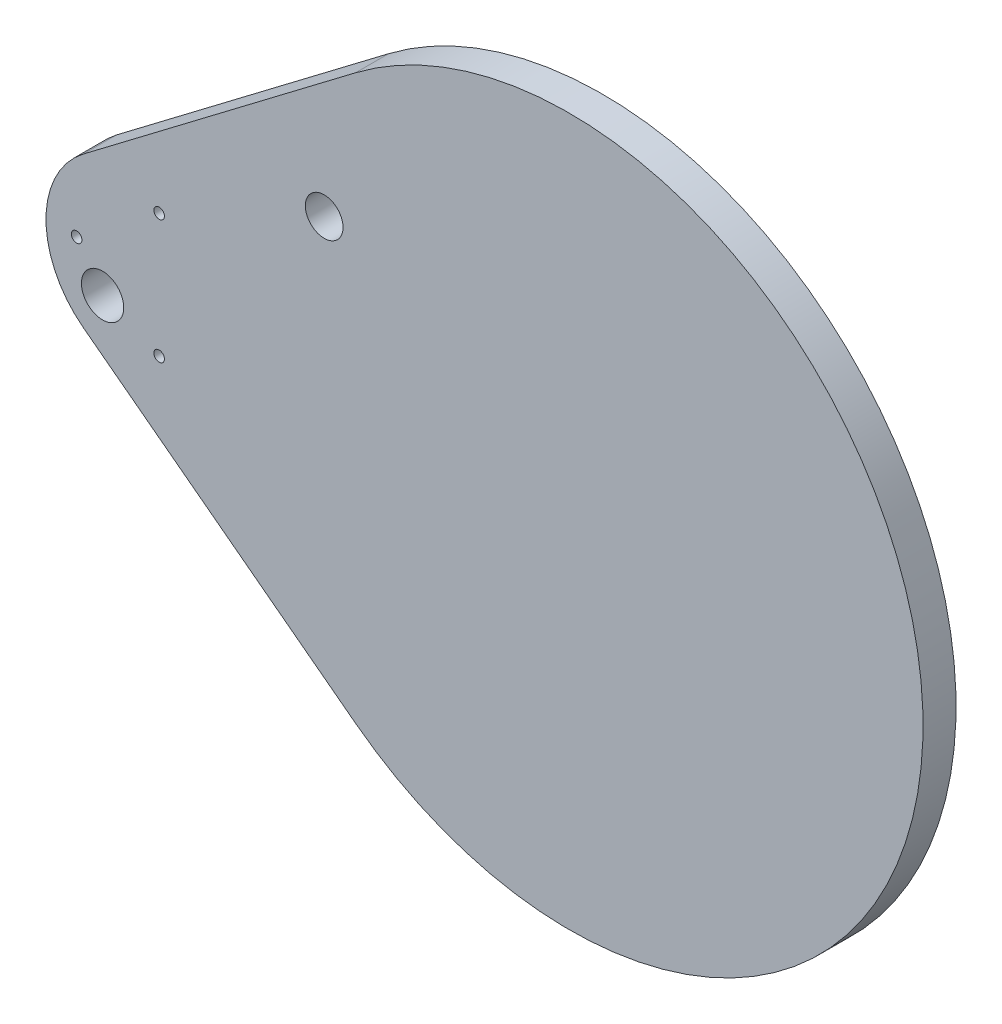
ISO-10303-21;
HEADER;
FILE_DESCRIPTION(('STEP AP214'),'2;1');
FILE_NAME('part.step','',(''),(''),'','','');
FILE_SCHEMA(('AUTOMOTIVE_DESIGN { 1 0 10303 214 1 1 1 1 }'));
ENDSEC;
DATA;
#1=APPLICATION_CONTEXT('core data for automotive mechanical design processes');
#2=APPLICATION_PROTOCOL_DEFINITION('international standard','automotive_design',2000,#1);
#3=PRODUCT_CONTEXT('',#1,'mechanical');
#4=PRODUCT('Part','Part','',(#3));
#5=PRODUCT_RELATED_PRODUCT_CATEGORY('part','',(#4));
#6=PRODUCT_DEFINITION_FORMATION('','',#4);
#7=PRODUCT_DEFINITION_CONTEXT('part definition',#1,'design');
#8=PRODUCT_DEFINITION('design','',#6,#7);
#9=PRODUCT_DEFINITION_SHAPE('','',#8);
#10=(LENGTH_UNIT() NAMED_UNIT(*) SI_UNIT(.MILLI.,.METRE.));
#11=(NAMED_UNIT(*) PLANE_ANGLE_UNIT() SI_UNIT($,.RADIAN.));
#12=(NAMED_UNIT(*) SI_UNIT($,.STERADIAN.) SOLID_ANGLE_UNIT());
#13=UNCERTAINTY_MEASURE_WITH_UNIT(LENGTH_MEASURE(1.E-05),#10,'distance_accuracy_value','');
#14=(GEOMETRIC_REPRESENTATION_CONTEXT(3) GLOBAL_UNCERTAINTY_ASSIGNED_CONTEXT((#13)) GLOBAL_UNIT_ASSIGNED_CONTEXT((#10,
#11,#12)) REPRESENTATION_CONTEXT('',''));
#15=CARTESIAN_POINT('',(0.,0.,0.));
#16=DIRECTION('',(0.,0.,1.));
#17=DIRECTION('',(1.,0.,0.));
#18=AXIS2_PLACEMENT_3D('',#15,#16,#17);
#19=CARTESIAN_POINT('',(0.,0.,22.225));
#20=DIRECTION('',(0.,0.,-1.));
#21=DIRECTION('',(-1.,0.,0.));
#22=AXIS2_PLACEMENT_3D('',#19,#20,#21);
#23=CYLINDRICAL_SURFACE('',#22,238.125);
#24=DIRECTION('',(0.,0.,-1.));
#25=VECTOR('',#24,1.);
#26=CARTESIAN_POINT('',(-143.921703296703,189.710460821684,22.225));
#27=LINE('',#26,#25);
#28=CARTESIAN_POINT('',(-143.921703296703,189.710460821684,22.225));
#29=VERTEX_POINT('',#28);
#30=CARTESIAN_POINT('',(-143.921703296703,189.710460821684,0.));
#31=VERTEX_POINT('',#30);
#32=EDGE_CURVE('E11',#29,#31,#27,.T.);
#33=ORIENTED_EDGE('',*,*,#32,.F.);
#34=CARTESIAN_POINT('',(0.,0.,22.225));
#35=DIRECTION('',(0.,0.,1.));
#36=DIRECTION('',(1.,0.,0.));
#37=AXIS2_PLACEMENT_3D('',#34,#35,#36);
#38=CIRCLE('',#37,238.125);
#39=CARTESIAN_POINT('',(-143.921703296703,-189.710460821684,22.225));
#40=VERTEX_POINT('',#39);
#41=EDGE_CURVE('E103',#40,#29,#38,.T.);
#42=ORIENTED_EDGE('',*,*,#41,.F.);
#43=DIRECTION('',(0.,0.,-1.));
#44=VECTOR('',#43,1.);
#45=CARTESIAN_POINT('',(-143.921703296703,-189.710460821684,22.225));
#46=LINE('',#45,#44);
#47=CARTESIAN_POINT('',(-143.921703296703,-189.710460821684,0.));
#48=VERTEX_POINT('',#47);
#49=EDGE_CURVE('E54',#40,#48,#46,.T.);
#50=ORIENTED_EDGE('',*,*,#49,.T.);
#51=CARTESIAN_POINT('',(0.,0.,0.));
#52=DIRECTION('',(0.,0.,1.));
#53=DIRECTION('',(1.,0.,0.));
#54=AXIS2_PLACEMENT_3D('',#51,#52,#53);
#55=CIRCLE('',#54,238.125);
#56=EDGE_CURVE('E90',#48,#31,#55,.T.);
#57=ORIENTED_EDGE('',*,*,#56,.T.);
#58=EDGE_LOOP('',(#33,#42,#50,#57));
#59=FACE_BOUND('',#58,.T.);
#60=ADVANCED_FACE('F39',(#59),#23,.T.);
#61=CARTESIAN_POINT('',(-327.304120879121,50.5894562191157,22.225));
#62=DIRECTION('',(-0.604395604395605,0.796684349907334,0.));
#63=DIRECTION('',(-0.796684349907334,-0.604395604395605,0.));
#64=AXIS2_PLACEMENT_3D('',#61,#62,#63);
#65=PLANE('',#64);
#66=DIRECTION('',(0.,0.,-1.));
#67=VECTOR('',#66,1.);
#68=CARTESIAN_POINT('',(-327.304120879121,50.5894562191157,22.225));
#69=LINE('',#68,#67);
#70=CARTESIAN_POINT('',(-327.304120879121,50.5894562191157,22.225));
#71=VERTEX_POINT('',#70);
#72=CARTESIAN_POINT('',(-327.304120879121,50.5894562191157,0.));
#73=VERTEX_POINT('',#72);
#74=EDGE_CURVE('E47',#71,#73,#69,.T.);
#75=ORIENTED_EDGE('',*,*,#74,.F.);
#76=DIRECTION('',(0.796684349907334,0.604395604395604,0.));
#77=VECTOR('',#76,1.);
#78=CARTESIAN_POINT('',(-327.304120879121,50.5894562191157,22.225));
#79=LINE('',#78,#77);
#80=EDGE_CURVE('E86',#71,#29,#79,.T.);
#81=ORIENTED_EDGE('',*,*,#80,.T.);
#82=ORIENTED_EDGE('',*,*,#32,.T.);
#83=DIRECTION('',(0.796684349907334,0.604395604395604,0.));
#84=VECTOR('',#83,1.);
#85=CARTESIAN_POINT('',(-327.304120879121,50.5894562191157,0.));
#86=LINE('',#85,#84);
#87=EDGE_CURVE('E83',#73,#31,#86,.T.);
#88=ORIENTED_EDGE('',*,*,#87,.F.);
#89=EDGE_LOOP('',(#75,#81,#82,#88));
#90=FACE_BOUND('',#89,.T.);
#91=ADVANCED_FACE('F41',(#90),#65,.T.);
#92=CARTESIAN_POINT('',(-288.925,0.,22.225));
#93=DIRECTION('',(0.,0.,-1.));
#94=DIRECTION('',(-1.,0.,0.));
#95=AXIS2_PLACEMENT_3D('',#92,#93,#94);
#96=CYLINDRICAL_SURFACE('',#95,63.5);
#97=DIRECTION('',(0.,0.,-1.));
#98=VECTOR('',#97,1.);
#99=CARTESIAN_POINT('',(-327.304120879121,-50.5894562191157,22.225));
#100=LINE('',#99,#98);
#101=CARTESIAN_POINT('',(-327.304120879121,-50.5894562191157,22.225));
#102=VERTEX_POINT('',#101);
#103=CARTESIAN_POINT('',(-327.304120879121,-50.5894562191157,0.));
#104=VERTEX_POINT('',#103);
#105=EDGE_CURVE('E62',#102,#104,#100,.T.);
#106=ORIENTED_EDGE('',*,*,#105,.F.);
#107=CARTESIAN_POINT('',(-288.925,0.,22.225));
#108=DIRECTION('',(0.,0.,1.));
#109=DIRECTION('',(1.,0.,0.));
#110=AXIS2_PLACEMENT_3D('',#107,#108,#109);
#111=CIRCLE('',#110,63.5);
#112=EDGE_CURVE('E106',#71,#102,#111,.T.);
#113=ORIENTED_EDGE('',*,*,#112,.F.);
#114=ORIENTED_EDGE('',*,*,#74,.T.);
#115=CARTESIAN_POINT('',(-288.925,0.,0.));
#116=DIRECTION('',(0.,0.,1.));
#117=DIRECTION('',(1.,0.,0.));
#118=AXIS2_PLACEMENT_3D('',#115,#116,#117);
#119=CIRCLE('',#118,63.5);
#120=EDGE_CURVE('E96',#73,#104,#119,.T.);
#121=ORIENTED_EDGE('',*,*,#120,.T.);
#122=EDGE_LOOP('',(#106,#113,#114,#121));
#123=FACE_BOUND('',#122,.T.);
#124=ADVANCED_FACE('F112',(#123),#96,.T.);
#125=CARTESIAN_POINT('',(-327.304120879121,-50.5894562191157,22.225));
#126=DIRECTION('',(0.604395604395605,0.796684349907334,0.));
#127=DIRECTION('',(-0.796684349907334,0.604395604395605,0.));
#128=AXIS2_PLACEMENT_3D('',#125,#126,#127);
#129=PLANE('',#128);
#130=DIRECTION('',(0.796684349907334,-0.604395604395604,0.));
#131=VECTOR('',#130,1.);
#132=CARTESIAN_POINT('',(-327.304120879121,-50.5894562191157,22.225));
#133=LINE('',#132,#131);
#134=EDGE_CURVE('E108',#102,#40,#133,.T.);
#135=ORIENTED_EDGE('',*,*,#134,.F.);
#136=ORIENTED_EDGE('',*,*,#105,.T.);
#137=DIRECTION('',(0.796684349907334,-0.604395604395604,0.));
#138=VECTOR('',#137,1.);
#139=CARTESIAN_POINT('',(-327.304120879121,-50.5894562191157,0.));
#140=LINE('',#139,#138);
#141=EDGE_CURVE('E98',#104,#48,#140,.T.);
#142=ORIENTED_EDGE('',*,*,#141,.T.);
#143=ORIENTED_EDGE('',*,*,#49,.F.);
#144=EDGE_LOOP('',(#135,#136,#142,#143));
#145=FACE_BOUND('',#144,.T.);
#146=ADVANCED_FACE('F115',(#145),#129,.F.);
#147=CARTESIAN_POINT('',(0.,0.,22.225));
#148=DIRECTION('',(0.,0.,1.));
#149=DIRECTION('',(1.,0.,0.));
#150=AXIS2_PLACEMENT_3D('',#147,#148,#149);
#151=PLANE('',#150);
#152=CARTESIAN_POINT('',(-165.1,95.25,22.225));
#153=DIRECTION('',(0.,0.,-1.));
#154=DIRECTION('',(-1.,0.,0.));
#155=AXIS2_PLACEMENT_3D('',#152,#153,#154);
#156=CIRCLE('',#155,12.7);
#157=CARTESIAN_POINT('',(-177.8,95.25,22.225));
#158=VERTEX_POINT('',#157);
#159=EDGE_CURVE('E165',#158,#158,#156,.T.);
#160=ORIENTED_EDGE('',*,*,#159,.T.);
#161=EDGE_LOOP('',(#160));
#162=FACE_BOUND('',#161,.T.);
#163=CARTESIAN_POINT('',(-276.225,-41.656,22.225));
#164=DIRECTION('',(0.,0.,-1.));
#165=DIRECTION('',(-1.,0.,0.));
#166=AXIS2_PLACEMENT_3D('',#163,#164,#165);
#167=CIRCLE('',#166,3.55600000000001);
#168=CARTESIAN_POINT('',(-279.781,-41.656,22.225));
#169=VERTEX_POINT('',#168);
#170=EDGE_CURVE('E175',#169,#169,#167,.T.);
#171=ORIENTED_EDGE('',*,*,#170,.T.);
#172=EDGE_LOOP('',(#171));
#173=FACE_BOUND('',#172,.T.);
#174=CARTESIAN_POINT('',(-276.225,41.656,22.225));
#175=DIRECTION('',(0.,0.,-1.));
#176=DIRECTION('',(-1.,0.,0.));
#177=AXIS2_PLACEMENT_3D('',#174,#175,#176);
#178=CIRCLE('',#177,3.55600000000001);
#179=CARTESIAN_POINT('',(-279.781,41.656,22.225));
#180=VERTEX_POINT('',#179);
#181=EDGE_CURVE('E181',#180,#180,#178,.T.);
#182=ORIENTED_EDGE('',*,*,#181,.T.);
#183=EDGE_LOOP('',(#182));
#184=FACE_BOUND('',#183,.T.);
#185=CARTESIAN_POINT('',(-331.7748,0.,22.225));
#186=DIRECTION('',(0.,0.,-1.));
#187=DIRECTION('',(-1.,0.,0.));
#188=AXIS2_PLACEMENT_3D('',#185,#186,#187);
#189=CIRCLE('',#188,3.55600000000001);
#190=CARTESIAN_POINT('',(-335.3308,0.,22.225));
#191=VERTEX_POINT('',#190);
#192=EDGE_CURVE('E187',#191,#191,#189,.T.);
#193=ORIENTED_EDGE('',*,*,#192,.T.);
#194=EDGE_LOOP('',(#193));
#195=FACE_BOUND('',#194,.T.);
#196=CARTESIAN_POINT('',(-314.325,-25.4,22.225));
#197=DIRECTION('',(0.,0.,-1.));
#198=DIRECTION('',(-1.,0.,0.));
#199=AXIS2_PLACEMENT_3D('',#196,#197,#198);
#200=CIRCLE('',#199,14.224);
#201=CARTESIAN_POINT('',(-328.549,-25.4,22.225));
#202=VERTEX_POINT('',#201);
#203=EDGE_CURVE('E193',#202,#202,#200,.T.);
#204=ORIENTED_EDGE('',*,*,#203,.T.);
#205=EDGE_LOOP('',(#204));
#206=FACE_BOUND('',#205,.T.);
#207=ORIENTED_EDGE('',*,*,#41,.T.);
#208=ORIENTED_EDGE('',*,*,#80,.F.);
#209=ORIENTED_EDGE('',*,*,#112,.T.);
#210=ORIENTED_EDGE('',*,*,#134,.T.);
#211=EDGE_LOOP('',(#207,#208,#209,#210));
#212=FACE_BOUND('',#211,.T.);
#213=ADVANCED_FACE('F114',(#162,#173,#184,#195,#206,#212),#151,.T.);
#214=CARTESIAN_POINT('',(0.,0.,0.));
#215=DIRECTION('',(0.,0.,1.));
#216=DIRECTION('',(1.,0.,0.));
#217=AXIS2_PLACEMENT_3D('',#214,#215,#216);
#218=PLANE('',#217);
#219=CARTESIAN_POINT('',(-165.1,95.25,0.));
#220=DIRECTION('',(0.,0.,-1.));
#221=DIRECTION('',(-1.,0.,0.));
#222=AXIS2_PLACEMENT_3D('',#219,#220,#221);
#223=CIRCLE('',#222,12.7);
#224=CARTESIAN_POINT('',(-177.8,95.25,0.));
#225=VERTEX_POINT('',#224);
#226=EDGE_CURVE('E168',#225,#225,#223,.T.);
#227=ORIENTED_EDGE('',*,*,#226,.F.);
#228=EDGE_LOOP('',(#227));
#229=FACE_BOUND('',#228,.T.);
#230=CARTESIAN_POINT('',(-276.225,-41.656,0.));
#231=DIRECTION('',(0.,0.,-1.));
#232=DIRECTION('',(-1.,0.,0.));
#233=AXIS2_PLACEMENT_3D('',#230,#231,#232);
#234=CIRCLE('',#233,3.55600000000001);
#235=CARTESIAN_POINT('',(-279.781,-41.656,0.));
#236=VERTEX_POINT('',#235);
#237=EDGE_CURVE('E170',#236,#236,#234,.T.);
#238=ORIENTED_EDGE('',*,*,#237,.F.);
#239=EDGE_LOOP('',(#238));
#240=FACE_BOUND('',#239,.T.);
#241=CARTESIAN_POINT('',(-276.225,41.656,0.));
#242=DIRECTION('',(0.,0.,-1.));
#243=DIRECTION('',(-1.,0.,0.));
#244=AXIS2_PLACEMENT_3D('',#241,#242,#243);
#245=CIRCLE('',#244,3.55600000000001);
#246=CARTESIAN_POINT('',(-279.781,41.656,0.));
#247=VERTEX_POINT('',#246);
#248=EDGE_CURVE('E178',#247,#247,#245,.T.);
#249=ORIENTED_EDGE('',*,*,#248,.F.);
#250=EDGE_LOOP('',(#249));
#251=FACE_BOUND('',#250,.T.);
#252=CARTESIAN_POINT('',(-331.7748,0.,0.));
#253=DIRECTION('',(0.,0.,-1.));
#254=DIRECTION('',(-1.,0.,0.));
#255=AXIS2_PLACEMENT_3D('',#252,#253,#254);
#256=CIRCLE('',#255,3.55600000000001);
#257=CARTESIAN_POINT('',(-335.3308,0.,0.));
#258=VERTEX_POINT('',#257);
#259=EDGE_CURVE('E184',#258,#258,#256,.T.);
#260=ORIENTED_EDGE('',*,*,#259,.F.);
#261=EDGE_LOOP('',(#260));
#262=FACE_BOUND('',#261,.T.);
#263=CARTESIAN_POINT('',(-314.325,-25.4,0.));
#264=DIRECTION('',(0.,0.,-1.));
#265=DIRECTION('',(-1.,0.,0.));
#266=AXIS2_PLACEMENT_3D('',#263,#264,#265);
#267=CIRCLE('',#266,14.224);
#268=CARTESIAN_POINT('',(-328.549,-25.4,0.));
#269=VERTEX_POINT('',#268);
#270=EDGE_CURVE('E190',#269,#269,#267,.T.);
#271=ORIENTED_EDGE('',*,*,#270,.F.);
#272=EDGE_LOOP('',(#271));
#273=FACE_BOUND('',#272,.T.);
#274=CARTESIAN_POINT('',(-288.925,0.,0.));
#275=DIRECTION('',(0.,0.,-1.));
#276=DIRECTION('',(-1.,0.,0.));
#277=AXIS2_PLACEMENT_3D('',#274,#275,#276);
#278=CIRCLE('',#277,11.1125);
#279=CARTESIAN_POINT('',(-300.0375,0.,0.));
#280=VERTEX_POINT('',#279);
#281=EDGE_CURVE('E196',#280,#280,#278,.T.);
#282=ORIENTED_EDGE('',*,*,#281,.F.);
#283=EDGE_LOOP('',(#282));
#284=FACE_BOUND('',#283,.T.);
#285=ORIENTED_EDGE('',*,*,#56,.F.);
#286=ORIENTED_EDGE('',*,*,#141,.F.);
#287=ORIENTED_EDGE('',*,*,#120,.F.);
#288=ORIENTED_EDGE('',*,*,#87,.T.);
#289=EDGE_LOOP('',(#285,#286,#287,#288));
#290=FACE_BOUND('',#289,.T.);
#291=ADVANCED_FACE('F95',(#229,#240,#251,#262,#273,#284,#290),#218,.F.);
#292=CARTESIAN_POINT('',(-288.925,0.,6.35));
#293=DIRECTION('',(0.,0.,-1.));
#294=DIRECTION('',(-1.,0.,0.));
#295=AXIS2_PLACEMENT_3D('',#292,#293,#294);
#296=CYLINDRICAL_SURFACE('',#295,11.1125);
#297=CARTESIAN_POINT('',(-288.925,0.,6.35));
#298=DIRECTION('',(0.,0.,-1.));
#299=DIRECTION('',(-1.,0.,0.));
#300=AXIS2_PLACEMENT_3D('',#297,#298,#299);
#301=CIRCLE('',#300,11.1125);
#302=CARTESIAN_POINT('',(-300.0375,0.,6.35));
#303=VERTEX_POINT('',#302);
#304=EDGE_CURVE('E93',#303,#303,#301,.T.);
#305=ORIENTED_EDGE('',*,*,#304,.F.);
#306=EDGE_LOOP('',(#305));
#307=FACE_BOUND('',#306,.T.);
#308=ORIENTED_EDGE('',*,*,#281,.T.);
#309=EDGE_LOOP('',(#308));
#310=FACE_BOUND('',#309,.T.);
#311=ADVANCED_FACE('F126',(#307,#310),#296,.F.);
#312=CARTESIAN_POINT('',(-288.925,0.,6.35));
#313=DIRECTION('',(0.,0.,-1.));
#314=DIRECTION('',(-1.,0.,0.));
#315=AXIS2_PLACEMENT_3D('',#312,#313,#314);
#316=PLANE('',#315);
#317=ORIENTED_EDGE('',*,*,#304,.T.);
#318=EDGE_LOOP('',(#317));
#319=FACE_BOUND('',#318,.T.);
#320=ADVANCED_FACE('F129',(#319),#316,.T.);
#321=CARTESIAN_POINT('',(-314.325,-25.4,22.225));
#322=DIRECTION('',(0.,0.,-1.));
#323=DIRECTION('',(-1.,0.,0.));
#324=AXIS2_PLACEMENT_3D('',#321,#322,#323);
#325=CYLINDRICAL_SURFACE('',#324,14.224);
#326=ORIENTED_EDGE('',*,*,#203,.F.);
#327=EDGE_LOOP('',(#326));
#328=FACE_BOUND('',#327,.T.);
#329=ORIENTED_EDGE('',*,*,#270,.T.);
#330=EDGE_LOOP('',(#329));
#331=FACE_BOUND('',#330,.T.);
#332=ADVANCED_FACE('F138',(#328,#331),#325,.F.);
#333=CARTESIAN_POINT('',(-331.7748,0.,22.225));
#334=DIRECTION('',(0.,0.,-1.));
#335=DIRECTION('',(-1.,0.,0.));
#336=AXIS2_PLACEMENT_3D('',#333,#334,#335);
#337=CYLINDRICAL_SURFACE('',#336,3.55600000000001);
#338=ORIENTED_EDGE('',*,*,#192,.F.);
#339=EDGE_LOOP('',(#338));
#340=FACE_BOUND('',#339,.T.);
#341=ORIENTED_EDGE('',*,*,#259,.T.);
#342=EDGE_LOOP('',(#341));
#343=FACE_BOUND('',#342,.T.);
#344=ADVANCED_FACE('F144',(#340,#343),#337,.F.);
#345=CARTESIAN_POINT('',(-276.225,41.656,22.225));
#346=DIRECTION('',(0.,0.,-1.));
#347=DIRECTION('',(-1.,0.,0.));
#348=AXIS2_PLACEMENT_3D('',#345,#346,#347);
#349=CYLINDRICAL_SURFACE('',#348,3.55600000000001);
#350=ORIENTED_EDGE('',*,*,#181,.F.);
#351=EDGE_LOOP('',(#350));
#352=FACE_BOUND('',#351,.T.);
#353=ORIENTED_EDGE('',*,*,#248,.T.);
#354=EDGE_LOOP('',(#353));
#355=FACE_BOUND('',#354,.T.);
#356=ADVANCED_FACE('F148',(#352,#355),#349,.F.);
#357=CARTESIAN_POINT('',(-276.225,-41.656,22.225));
#358=DIRECTION('',(0.,0.,-1.));
#359=DIRECTION('',(-1.,0.,0.));
#360=AXIS2_PLACEMENT_3D('',#357,#358,#359);
#361=CYLINDRICAL_SURFACE('',#360,3.55600000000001);
#362=ORIENTED_EDGE('',*,*,#170,.F.);
#363=EDGE_LOOP('',(#362));
#364=FACE_BOUND('',#363,.T.);
#365=ORIENTED_EDGE('',*,*,#237,.T.);
#366=EDGE_LOOP('',(#365));
#367=FACE_BOUND('',#366,.T.);
#368=ADVANCED_FACE('F152',(#364,#367),#361,.F.);
#369=CARTESIAN_POINT('',(-165.1,95.25,22.225));
#370=DIRECTION('',(0.,0.,-1.));
#371=DIRECTION('',(-1.,0.,0.));
#372=AXIS2_PLACEMENT_3D('',#369,#370,#371);
#373=CYLINDRICAL_SURFACE('',#372,12.7);
#374=ORIENTED_EDGE('',*,*,#159,.F.);
#375=EDGE_LOOP('',(#374));
#376=FACE_BOUND('',#375,.T.);
#377=ORIENTED_EDGE('',*,*,#226,.T.);
#378=EDGE_LOOP('',(#377));
#379=FACE_BOUND('',#378,.T.);
#380=ADVANCED_FACE('F156',(#376,#379),#373,.F.);
#381=CLOSED_SHELL('',(#60,#91,#124,#146,#213,#291,#311,#320,#332,#344,#356,#368,#380));
#382=MANIFOLD_SOLID_BREP('B2',#381);
#383=ADVANCED_BREP_SHAPE_REPRESENTATION('',(#18,#382),#14);
#384=SHAPE_DEFINITION_REPRESENTATION(#9,#383);
ENDSEC;
END-ISO-10303-21;
